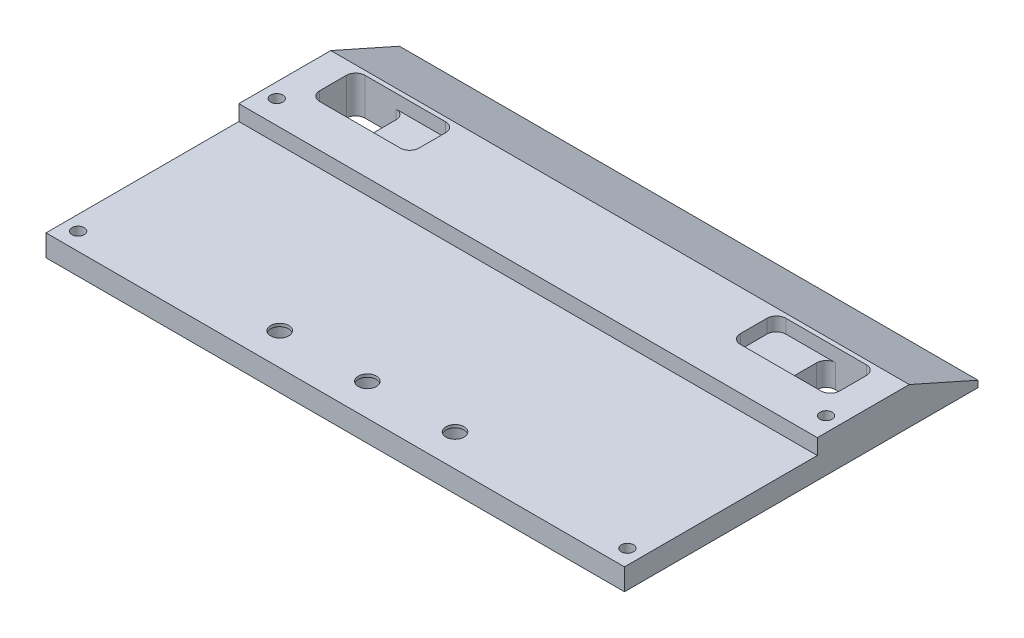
from build123d import *

# Parameters (mm, degrees)
SALIENTE_EXTRUIR1_DEPTH = 99
CROQUIS3_R              = 2.85
CROQUIS3_R_2            = 1.55
CORTAR_EXTRUIR1_DEPTH   = 3.2
CROQUIS3_3_R            = 1.55
CORTAR_EXTRUIR2_DEPTH   = 135.957669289
CORTAR_EXTRUIR3_DEPTH   = 135.957669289
SALIENTE_EXTRUIR2_START = -4
SALIENTE_EXTRUIR2_DEPTH = 4
CROQUIS9_R              = 1.05
CORTAR_EXTRUIR5_DEPTH   = 135.957669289


with BuildPart() as part:
    # Croquis1 → Saliente-Extruir1 (new body)
    with BuildSketch(Plane(origin=(0, 0, 0), x_dir=(0, 0, -1), z_dir=(1, 0, 0))):
        Polygon((91.5, 0), (91.5, 1.113071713), (79.737666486, 6.35), (64, 6.35), (64, 3.7), (40.35, 3.7), (31, 3.7), (31, 0), align=None)
    extrude(amount=-SALIENTE_EXTRUIR1_DEPTH)

    # Croquis3 → Cortar-Extruir1 (cut)
    # profile 1 of 6: a face of its own
    with BuildSketch(Plane.XZ):
        with Locations(Location((-64.5, -36.5, 0), (0, 0, 270))):
            Circle(CROQUIS3_R)
        with Locations((-64.5, -36.5)):
            Circle(CROQUIS3_R_2, mode=Mode.SUBTRACT)
    # profile 2 of 6: a face of its own
    with BuildSketch(Plane.XZ):
        with Locations((-64.5, -36.5)):
            Circle(CROQUIS3_R_2)
    # profile 3 of 6: a face of its own
    with BuildSketch(Plane.XZ):
        with Locations(Location((-49.5, -36.5, 0), (0, 0, 270))):
            Circle(CROQUIS3_R)
        with Locations((-49.5, -36.5)):
            Circle(CROQUIS3_R_2, mode=Mode.SUBTRACT)
    # profile 4 of 6: a face of its own
    with BuildSketch(Plane.XZ):
        with Locations((-49.5, -36.5)):
            Circle(CROQUIS3_R_2)
    # profile 5 of 6: a face of its own
    with BuildSketch(Plane.XZ):
        with Locations(Location((-34.5, -36.5, 0), (0, 0, 270))):
            Circle(CROQUIS3_R)
        with Locations((-34.5, -36.5)):
            Circle(CROQUIS3_R_2, mode=Mode.SUBTRACT)
    # profile 6 of 6: a face of its own
    with BuildSketch(Plane.XZ):
        with Locations((-34.5, -36.5)):
            Circle(CROQUIS3_R_2)
    extrude(amount=-CORTAR_EXTRUIR1_DEPTH, mode=Mode.SUBTRACT)

    # Croquis3_3 → Cortar-Extruir2 (cut, through all)
    with BuildSketch(Plane.XZ):
        with Locations(Location((-64.5, -36.5, 0), (0, 0, 270))):
            Circle(CROQUIS3_3_R)
        with Locations(Location((-49.5, -36.5, 0), (0, 0, 270))):
            Circle(CROQUIS3_3_R)
        with Locations(Location((-34.5, -36.5, 0), (0, 0, 270))):
            Circle(CROQUIS3_3_R)
    extrude(amount=-CORTAR_EXTRUIR2_DEPTH, mode=Mode.SUBTRACT)

    # Croquis4 → Cortar-Extruir3 (cut, through all)
    with BuildSketch(Plane(origin=(0, 6.35, 0), x_dir=(1, 0, 0), z_dir=(0, 1, 0))):
        with BuildLine():
            Line((-6.6, 79), (-20.4, 79))
            ThreePointArc((-20.4, 79), (-21.53137085, 78.53137085), (-22, 77.4))
            Line((-22, 77.4), (-22, 72.83))
            ThreePointArc((-22, 72.83), (-21.53137085, 71.69862915), (-20.4, 71.23))
            Line((-20.4, 71.23), (-6.6, 71.23))
            ThreePointArc((-6.6, 71.23), (-5.46862915, 71.69862915), (-5, 72.83))
            Line((-5, 72.83), (-5, 77.4))
            ThreePointArc((-5, 77.4), (-5.46862915, 78.53137085), (-6.6, 79))
        make_face()
        with BuildLine():
            Line((-77, 77.4), (-77, 72.83))
            ThreePointArc((-77, 72.83), (-77.46862915, 71.69862915), (-78.6, 71.23))
            Line((-78.6, 71.23), (-92.4, 71.23))
            ThreePointArc((-92.4, 71.23), (-93.53137085, 71.69862915), (-94, 72.83))
            Line((-94, 72.83), (-94, 77.4))
            ThreePointArc((-94, 77.4), (-93.53137085, 78.53137085), (-92.4, 79))
            Line((-92.4, 79), (-78.6, 79))
            ThreePointArc((-78.6, 79), (-77.46862915, 78.53137085), (-77, 77.4))
        make_face()
    extrude(amount=-CORTAR_EXTRUIR3_DEPTH, mode=Mode.SUBTRACT)

    # Croquis6 → Saliente-Extruir2 (add)
    with BuildSketch(Plane.XZ.offset(SALIENTE_EXTRUIR2_START)):
        with BuildLine():
            Line((-13.5, -72.83), (-13.5, -77.4))
            ThreePointArc((-13.5, -77.4), (-13.03137085, -78.53137085), (-11.9, -79))
            Line((-11.9, -79), (-20.4, -79))
            ThreePointArc((-20.4, -79), (-21.53137085, -78.53137085), (-22, -77.4))
            Line((-22, -77.4), (-22, -72.83))
            ThreePointArc((-22, -72.83), (-21.53137085, -71.69862915), (-20.4, -71.23))
            Line((-20.4, -71.23), (-11.9, -71.23))
            ThreePointArc((-11.9, -71.23), (-13.03137085, -71.69862915), (-13.5, -72.83))
        make_face()
        with BuildLine():
            Line((-85.5, -72.83), (-85.5, -77.4))
            ThreePointArc((-85.5, -77.4), (-85.96862915, -78.53137085), (-87.1, -79))
            Line((-87.1, -79), (-78.6, -79))
            ThreePointArc((-78.6, -79), (-77.46862915, -78.53137085), (-77, -77.4))
            Line((-77, -77.4), (-77, -72.83))
            ThreePointArc((-77, -72.83), (-77.46862915, -71.69862915), (-78.6, -71.23))
            Line((-78.6, -71.23), (-87.1, -71.23))
            ThreePointArc((-87.1, -71.23), (-85.96862915, -71.69862915), (-85.5, -72.83))
        make_face()
    extrude(amount=SALIENTE_EXTRUIR2_DEPTH)

    # Croquis9 → Cortar-Extruir5 (cut, through all)
    with BuildSketch(Plane(origin=(0, 6.35, 0), x_dir=(1, 0, 0), z_dir=(0, 1, 0))):
        with Locations(Location((-2.5, 68, 0), (0, 0, 270))):
            Circle(CROQUIS9_R)
        with Locations(Location((-2.5, 34, 0), (0, 0, 270))):
            Circle(CROQUIS9_R)
        with Locations(Location((-96.5, 34, 0), (0, 0, 270))):
            Circle(CROQUIS9_R)
        with Locations(Location((-96.5, 68, 0), (0, 0, 90))):
            Circle(CROQUIS9_R)
    extrude(amount=-CORTAR_EXTRUIR5_DEPTH, mode=Mode.SUBTRACT)


solid = part.part
